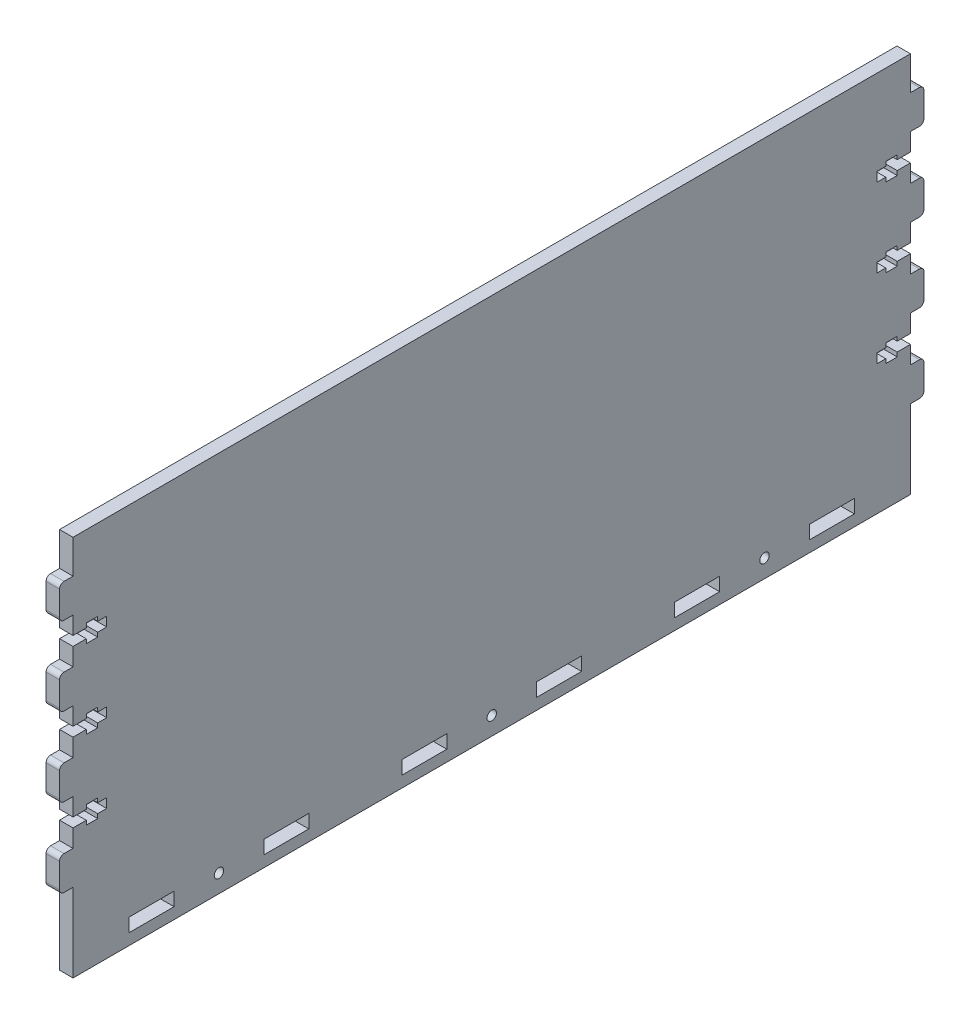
from build123d import *

# Parameters (mm, degrees)
EXTRUDE_1_DEPTH     = 6
SKETCH_2_R          = 2.1
SKETCH_2_W          = 20
SKETCH_2_H          = 6
CUT_EXTRUDE_1_DEPTH = 416.423879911


with BuildPart() as part:
    # Sketch 1 → Extrude 1 (new body)
    with BuildSketch(Plane(origin=(0, 0, 0), x_dir=(0, 0, -1), z_dir=(1, 0, 0))):
        with BuildLine():
            Line((0, 35), (0, 0))
            Line((0, 0), (373, 0))
            Line((373, 0), (373, 35))
            Line((373, 35), (377, 35))
            ThreePointArc((377, 35), (378.414213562, 35.585786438), (379, 37))
            Line((379, 37), (379, 48))
            ThreePointArc((379, 48), (378.414213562, 49.414213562), (377, 50))
            Line((377, 50), (373, 50))
            Line((373, 50), (373, 57.9))
            Line((373, 57.9), (367.1, 57.9))
            Line((367.1, 57.9), (367.1, 56))
            Line((367.1, 56), (362, 56))
            Line((362, 56), (362, 57.9))
            Line((362, 57.9), (358, 57.9))
            Line((358, 57.9), (358, 62.1))
            Line((358, 62.1), (362, 62.1))
            Line((362, 62.1), (362, 64))
            Line((362, 64), (367.1, 64))
            Line((367.1, 64), (367.1, 62.1))
            Line((367.1, 62.1), (373, 62.1))
            Line((373, 62.1), (373, 70))
            Line((373, 70), (377, 70))
            ThreePointArc((377, 70), (378.414213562, 70.585786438), (379, 72))
            Line((379, 72), (379, 83))
            ThreePointArc((379, 83), (378.414213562, 84.414213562), (377, 85))
            Line((377, 85), (373, 85))
            Line((373, 85), (373, 92.9))
            Line((373, 92.9), (367.1, 92.9))
            Line((367.1, 92.9), (367.1, 91))
            Line((367.1, 91), (362, 91))
            Line((362, 91), (362, 92.9))
            Line((362, 92.9), (358, 92.9))
            Line((358, 92.9), (358, 97.1))
            Line((358, 97.1), (362, 97.1))
            Line((362, 97.1), (362, 99))
            Line((362, 99), (367.1, 99))
            Line((367.1, 99), (367.1, 97.1))
            Line((367.1, 97.1), (373, 97.1))
            Line((373, 97.1), (373, 105))
            Line((373, 105), (377, 105))
            ThreePointArc((377, 105), (378.414213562, 105.585786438), (379, 107))
            Line((379, 107), (379, 118))
            ThreePointArc((379, 118), (378.414213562, 119.414213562), (377, 120))
            Line((377, 120), (373, 120))
            Line((373, 120), (373, 127.9))
            Line((373, 127.9), (367.1, 127.9))
            Line((367.1, 127.9), (367.1, 126))
            Line((367.1, 126), (362, 126))
            Line((362, 126), (362, 127.9))
            Line((362, 127.9), (358, 127.9))
            Line((358, 127.9), (358, 132.1))
            Line((358, 132.1), (362, 132.1))
            Line((362, 132.1), (362, 134))
            Line((362, 134), (367.1, 134))
            Line((367.1, 134), (367.1, 132.1))
            Line((367.1, 132.1), (373, 132.1))
            Line((373, 132.1), (373, 140))
            Line((373, 140), (377, 140))
            ThreePointArc((377, 140), (378.414213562, 140.585786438), (379, 142))
            Line((379, 142), (379, 153))
            ThreePointArc((379, 153), (378.414213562, 154.414213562), (377, 155))
            Line((377, 155), (373, 155))
            Line((373, 155), (373, 170))
            Line((373, 170), (0, 170))
            Line((0, 170), (0, 155))
            Line((0, 155), (-4, 155))
            ThreePointArc((-4, 155), (-5.414213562, 154.414213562), (-6, 153))
            Line((-6, 153), (-6, 142))
            ThreePointArc((-6, 142), (-5.414213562, 140.585786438), (-4, 140))
            Line((-4, 140), (0, 140))
            Line((0, 140), (0, 132.1))
            Line((0, 132.1), (5.9, 132.1))
            Line((5.9, 132.1), (5.9, 134))
            Line((5.9, 134), (11, 134))
            Line((11, 134), (11, 132.1))
            Line((11, 132.1), (15, 132.1))
            Line((15, 132.1), (15, 127.9))
            Line((15, 127.9), (11, 127.9))
            Line((11, 127.9), (11, 126))
            Line((11, 126), (5.9, 126))
            Line((5.9, 126), (5.9, 127.9))
            Line((5.9, 127.9), (0, 127.9))
            Line((0, 127.9), (0, 120))
            Line((0, 120), (-4, 120))
            ThreePointArc((-4, 120), (-5.414213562, 119.414213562), (-6, 118))
            Line((-6, 118), (-6, 107))
            ThreePointArc((-6, 107), (-5.414213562, 105.585786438), (-4, 105))
            Line((-4, 105), (0, 105))
            Line((0, 105), (0, 97.1))
            Line((0, 97.1), (5.9, 97.1))
            Line((5.9, 97.1), (5.9, 99))
            Line((5.9, 99), (11, 99))
            Line((11, 99), (11, 97.1))
            Line((11, 97.1), (15, 97.1))
            Line((15, 97.1), (15, 92.9))
            Line((15, 92.9), (11, 92.9))
            Line((11, 92.9), (11, 91))
            Line((11, 91), (5.9, 91))
            Line((5.9, 91), (5.9, 92.9))
            Line((5.9, 92.9), (0, 92.9))
            Line((0, 92.9), (0, 85))
            Line((0, 85), (-4, 85))
            ThreePointArc((-4, 85), (-5.414213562, 84.414213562), (-6, 83))
            Line((-6, 83), (-6, 72))
            ThreePointArc((-6, 72), (-5.414213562, 70.585786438), (-4, 70))
            Line((-4, 70), (0, 70))
            Line((0, 70), (0, 62.1))
            Line((0, 62.1), (5.9, 62.1))
            Line((5.9, 62.1), (5.9, 64))
            Line((5.9, 64), (11, 64))
            Line((11, 64), (11, 62.1))
            Line((11, 62.1), (15, 62.1))
            Line((15, 62.1), (15, 57.9))
            Line((15, 57.9), (11, 57.9))
            Line((11, 57.9), (11, 56))
            Line((11, 56), (5.9, 56))
            Line((5.9, 56), (5.9, 57.9))
            Line((5.9, 57.9), (0, 57.9))
            Line((0, 57.9), (0, 50))
            Line((0, 50), (-4, 50))
            ThreePointArc((-4, 50), (-5.414213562, 49.414213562), (-6, 48))
            Line((-6, 48), (-6, 37))
            ThreePointArc((-6, 37), (-5.414213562, 35.585786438), (-4, 35))
            Line((-4, 35), (0, 35))
        make_face()
    extrude(amount=EXTRUDE_1_DEPTH)

    # Sketch 2 → Cut-Extrude 1 (cut, through all)
    with BuildSketch(Plane(origin=(6, 0, 0), x_dir=(0, 0, -1), z_dir=(1, 0, 0))):
        with Locations((65, 8)):
            Circle(SKETCH_2_R)
        with Locations((186.5, 8)):
            Circle(SKETCH_2_R)
        with Locations(Location((308, 8, 0), (0, 0, 180))):
            Circle(SKETCH_2_R)
        with Locations((35, 8)):
            Rectangle(SKETCH_2_W, SKETCH_2_H)
        with Locations((95, 8)):
            Rectangle(SKETCH_2_W, SKETCH_2_H)
        with Locations((156.5, 8)):
            Rectangle(SKETCH_2_W, SKETCH_2_H)
        with Locations((216.5, 8)):
            Rectangle(SKETCH_2_W, SKETCH_2_H)
        with Locations((278, 8)):
            Rectangle(SKETCH_2_W, SKETCH_2_H)
        with Locations((338, 8)):
            Rectangle(SKETCH_2_W, SKETCH_2_H)
    extrude(amount=-CUT_EXTRUDE_1_DEPTH, mode=Mode.SUBTRACT)


solid = part.part
